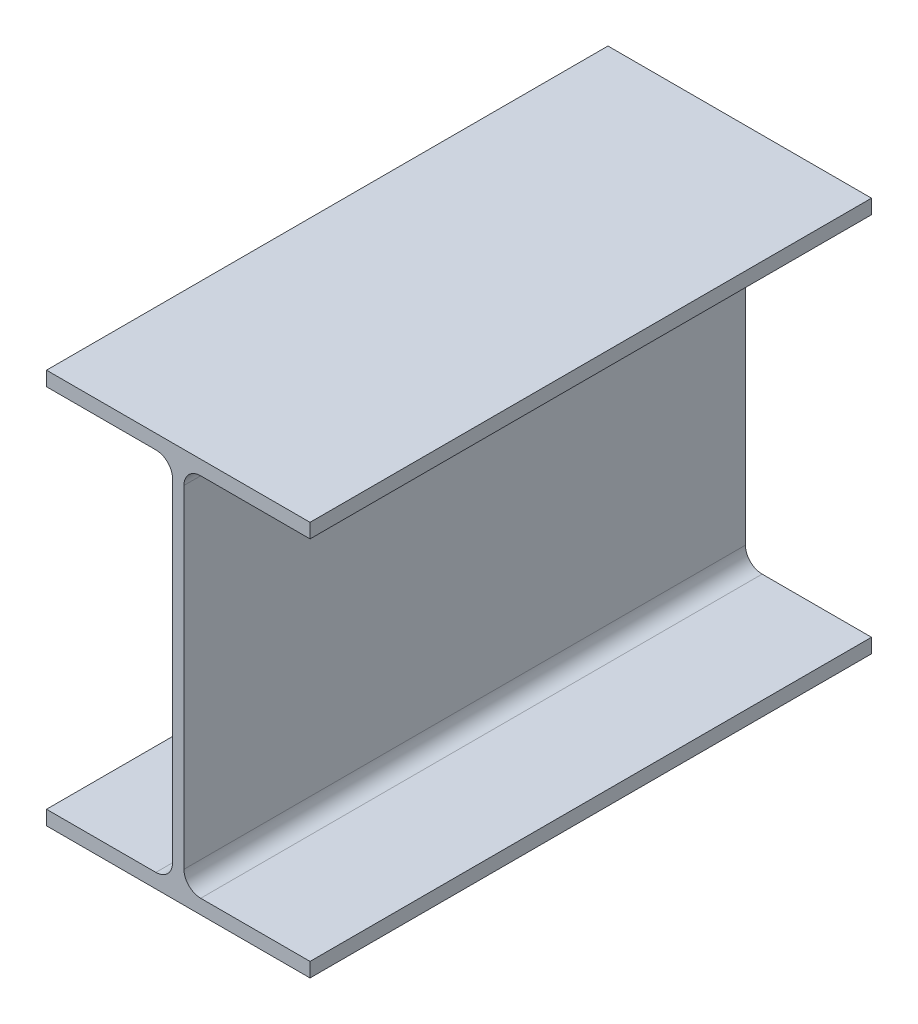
ISO-10303-21;
HEADER;
FILE_DESCRIPTION(('STEP AP214'),'2;1');
FILE_NAME('part.step','',(''),(''),'','','');
FILE_SCHEMA(('AUTOMOTIVE_DESIGN { 1 0 10303 214 1 1 1 1 }'));
ENDSEC;
DATA;
#1=APPLICATION_CONTEXT('core data for automotive mechanical design processes');
#2=APPLICATION_PROTOCOL_DEFINITION('international standard','automotive_design',2000,#1);
#3=PRODUCT_CONTEXT('',#1,'mechanical');
#4=PRODUCT('Part','Part','',(#3));
#5=PRODUCT_RELATED_PRODUCT_CATEGORY('part','',(#4));
#6=PRODUCT_DEFINITION_FORMATION('','',#4);
#7=PRODUCT_DEFINITION_CONTEXT('part definition',#1,'design');
#8=PRODUCT_DEFINITION('design','',#6,#7);
#9=PRODUCT_DEFINITION_SHAPE('','',#8);
#10=(LENGTH_UNIT() NAMED_UNIT(*) SI_UNIT(.MILLI.,.METRE.));
#11=(NAMED_UNIT(*) PLANE_ANGLE_UNIT() SI_UNIT($,.RADIAN.));
#12=(NAMED_UNIT(*) SI_UNIT($,.STERADIAN.) SOLID_ANGLE_UNIT());
#13=UNCERTAINTY_MEASURE_WITH_UNIT(LENGTH_MEASURE(1.E-05),#10,'distance_accuracy_value','');
#14=(GEOMETRIC_REPRESENTATION_CONTEXT(3) GLOBAL_UNCERTAINTY_ASSIGNED_CONTEXT((#13)) GLOBAL_UNIT_ASSIGNED_CONTEXT((#10,
#11,#12)) REPRESENTATION_CONTEXT('',''));
#15=CARTESIAN_POINT('',(0.,0.,0.));
#16=DIRECTION('',(0.,0.,1.));
#17=DIRECTION('',(1.,0.,0.));
#18=AXIS2_PLACEMENT_3D('',#15,#16,#17);
#19=CARTESIAN_POINT('',(50.0379999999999,-74.93,213.205063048));
#20=DIRECTION('',(0.,1.,0.));
#21=DIRECTION('',(0.,0.,1.));
#22=AXIS2_PLACEMENT_3D('',#19,#20,#21);
#23=PLANE('',#22);
#24=DIRECTION('',(1.,0.,0.));
#25=VECTOR('',#24,1.);
#26=CARTESIAN_POINT('',(50.0379999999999,-74.93,0.));
#27=LINE('',#26,#25);
#28=CARTESIAN_POINT('',(-50.0379999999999,-74.93,0.));
#29=VERTEX_POINT('',#28);
#30=CARTESIAN_POINT('',(50.0379999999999,-74.93,0.));
#31=VERTEX_POINT('',#30);
#32=EDGE_CURVE('E179',#29,#31,#27,.T.);
#33=ORIENTED_EDGE('',*,*,#32,.T.);
#34=DIRECTION('',(0.,0.,-1.));
#35=VECTOR('',#34,1.);
#36=CARTESIAN_POINT('',(50.0379999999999,-74.93,213.205063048));
#37=LINE('',#36,#35);
#38=CARTESIAN_POINT('',(50.0379999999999,-74.93,213.205063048));
#39=VERTEX_POINT('',#38);
#40=EDGE_CURVE('E11',#39,#31,#37,.T.);
#41=ORIENTED_EDGE('',*,*,#40,.F.);
#42=DIRECTION('',(1.,0.,0.));
#43=VECTOR('',#42,1.);
#44=CARTESIAN_POINT('',(50.0379999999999,-74.93,213.205063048));
#45=LINE('',#44,#43);
#46=CARTESIAN_POINT('',(-50.0379999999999,-74.93,213.205063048));
#47=VERTEX_POINT('',#46);
#48=EDGE_CURVE('E209',#47,#39,#45,.T.);
#49=ORIENTED_EDGE('',*,*,#48,.F.);
#50=DIRECTION('',(0.,0.,-1.));
#51=VECTOR('',#50,1.);
#52=CARTESIAN_POINT('',(-50.0379999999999,-74.93,213.205063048));
#53=LINE('',#52,#51);
#54=EDGE_CURVE('E175',#47,#29,#53,.T.);
#55=ORIENTED_EDGE('',*,*,#54,.T.);
#56=EDGE_LOOP('',(#33,#41,#49,#55));
#57=FACE_BOUND('',#56,.T.);
#58=ADVANCED_FACE('F35',(#57),#23,.F.);
#59=CARTESIAN_POINT('',(50.0379999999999,-69.469,213.205063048));
#60=DIRECTION('',(-1.,0.,0.));
#61=DIRECTION('',(0.,0.,1.));
#62=AXIS2_PLACEMENT_3D('',#59,#60,#61);
#63=PLANE('',#62);
#64=DIRECTION('',(0.,1.,0.));
#65=VECTOR('',#64,1.);
#66=CARTESIAN_POINT('',(50.0379999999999,-69.469,0.));
#67=LINE('',#66,#65);
#68=CARTESIAN_POINT('',(50.0379999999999,-69.469,0.));
#69=VERTEX_POINT('',#68);
#70=EDGE_CURVE('E182',#31,#69,#67,.T.);
#71=ORIENTED_EDGE('',*,*,#70,.T.);
#72=DIRECTION('',(0.,0.,-1.));
#73=VECTOR('',#72,1.);
#74=CARTESIAN_POINT('',(50.0379999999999,-69.469,213.205063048));
#75=LINE('',#74,#73);
#76=CARTESIAN_POINT('',(50.0379999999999,-69.469,213.205063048));
#77=VERTEX_POINT('',#76);
#78=EDGE_CURVE('E43',#77,#69,#75,.T.);
#79=ORIENTED_EDGE('',*,*,#78,.F.);
#80=DIRECTION('',(0.,1.,0.));
#81=VECTOR('',#80,1.);
#82=CARTESIAN_POINT('',(50.0379999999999,-69.469,213.205063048));
#83=LINE('',#82,#81);
#84=EDGE_CURVE('E118',#39,#77,#83,.T.);
#85=ORIENTED_EDGE('',*,*,#84,.F.);
#86=ORIENTED_EDGE('',*,*,#40,.T.);
#87=EDGE_LOOP('',(#71,#79,#85,#86));
#88=FACE_BOUND('',#87,.T.);
#89=ADVANCED_FACE('F307',(#88),#63,.F.);
#90=CARTESIAN_POINT('',(8.50900000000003,-69.469,213.205063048));
#91=DIRECTION('',(0.,-1.,0.));
#92=DIRECTION('',(1.,0.,0.));
#93=AXIS2_PLACEMENT_3D('',#90,#91,#92);
#94=PLANE('',#93);
#95=DIRECTION('',(-1.,0.,0.));
#96=VECTOR('',#95,1.);
#97=CARTESIAN_POINT('',(8.50900000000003,-69.469,0.));
#98=LINE('',#97,#96);
#99=CARTESIAN_POINT('',(8.50900000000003,-69.469,0.));
#100=VERTEX_POINT('',#99);
#101=EDGE_CURVE('E184',#69,#100,#98,.T.);
#102=ORIENTED_EDGE('',*,*,#101,.T.);
#103=DIRECTION('',(0.,0.,-1.));
#104=VECTOR('',#103,1.);
#105=CARTESIAN_POINT('',(8.50900000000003,-69.469,213.205063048));
#106=LINE('',#105,#104);
#107=CARTESIAN_POINT('',(8.50900000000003,-69.469,213.205063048));
#108=VERTEX_POINT('',#107);
#109=EDGE_CURVE('E240',#108,#100,#106,.T.);
#110=ORIENTED_EDGE('',*,*,#109,.F.);
#111=DIRECTION('',(-1.,0.,0.));
#112=VECTOR('',#111,1.);
#113=CARTESIAN_POINT('',(8.50900000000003,-69.469,213.205063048));
#114=LINE('',#113,#112);
#115=EDGE_CURVE('E248',#77,#108,#114,.T.);
#116=ORIENTED_EDGE('',*,*,#115,.F.);
#117=ORIENTED_EDGE('',*,*,#78,.T.);
#118=EDGE_LOOP('',(#102,#110,#116,#117));
#119=FACE_BOUND('',#118,.T.);
#120=ADVANCED_FACE('F246',(#119),#94,.F.);
#121=CARTESIAN_POINT('',(8.50900000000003,-63.119,213.205063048));
#122=DIRECTION('',(0.,0.,-1.));
#123=DIRECTION('',(-1.,0.,0.));
#124=AXIS2_PLACEMENT_3D('',#121,#122,#123);
#125=CYLINDRICAL_SURFACE('',#124,6.34999999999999);
#126=CARTESIAN_POINT('',(8.50900000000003,-63.119,0.));
#127=DIRECTION('',(0.,0.,-1.));
#128=DIRECTION('',(1.,0.,0.));
#129=AXIS2_PLACEMENT_3D('',#126,#127,#128);
#130=CIRCLE('',#129,6.34999999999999);
#131=CARTESIAN_POINT('',(2.15900000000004,-63.119,0.));
#132=VERTEX_POINT('',#131);
#133=EDGE_CURVE('E186',#100,#132,#130,.T.);
#134=ORIENTED_EDGE('',*,*,#133,.T.);
#135=DIRECTION('',(0.,0.,-1.));
#136=VECTOR('',#135,1.);
#137=CARTESIAN_POINT('',(2.15900000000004,-63.119,213.205063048));
#138=LINE('',#137,#136);
#139=CARTESIAN_POINT('',(2.15900000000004,-63.119,213.205063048));
#140=VERTEX_POINT('',#139);
#141=EDGE_CURVE('E237',#140,#132,#138,.T.);
#142=ORIENTED_EDGE('',*,*,#141,.F.);
#143=CARTESIAN_POINT('',(8.50900000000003,-63.119,213.205063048));
#144=DIRECTION('',(0.,0.,-1.));
#145=DIRECTION('',(1.,0.,0.));
#146=AXIS2_PLACEMENT_3D('',#143,#144,#145);
#147=CIRCLE('',#146,6.34999999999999);
#148=EDGE_CURVE('E266',#108,#140,#147,.T.);
#149=ORIENTED_EDGE('',*,*,#148,.F.);
#150=ORIENTED_EDGE('',*,*,#109,.T.);
#151=EDGE_LOOP('',(#134,#142,#149,#150));
#152=FACE_BOUND('',#151,.T.);
#153=ADVANCED_FACE('F257',(#152),#125,.F.);
#154=CARTESIAN_POINT('',(2.15900000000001,63.119,213.205063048));
#155=DIRECTION('',(-1.,0.,0.));
#156=DIRECTION('',(0.,-1.,0.));
#157=AXIS2_PLACEMENT_3D('',#154,#155,#156);
#158=PLANE('',#157);
#159=DIRECTION('',(0.,1.,0.));
#160=VECTOR('',#159,1.);
#161=CARTESIAN_POINT('',(2.15900000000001,63.119,0.));
#162=LINE('',#161,#160);
#163=CARTESIAN_POINT('',(2.15900000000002,63.119,0.));
#164=VERTEX_POINT('',#163);
#165=EDGE_CURVE('E188',#132,#164,#162,.T.);
#166=ORIENTED_EDGE('',*,*,#165,.T.);
#167=DIRECTION('',(0.,0.,-1.));
#168=VECTOR('',#167,1.);
#169=CARTESIAN_POINT('',(2.15900000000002,63.119,213.205063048));
#170=LINE('',#169,#168);
#171=CARTESIAN_POINT('',(2.15900000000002,63.119,213.205063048));
#172=VERTEX_POINT('',#171);
#173=EDGE_CURVE('E234',#172,#164,#170,.T.);
#174=ORIENTED_EDGE('',*,*,#173,.F.);
#175=DIRECTION('',(0.,1.,0.));
#176=VECTOR('',#175,1.);
#177=CARTESIAN_POINT('',(2.15900000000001,63.119,213.205063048));
#178=LINE('',#177,#176);
#179=EDGE_CURVE('E263',#140,#172,#178,.T.);
#180=ORIENTED_EDGE('',*,*,#179,.F.);
#181=ORIENTED_EDGE('',*,*,#141,.T.);
#182=EDGE_LOOP('',(#166,#174,#180,#181));
#183=FACE_BOUND('',#182,.T.);
#184=ADVANCED_FACE('F261',(#183),#158,.F.);
#185=CARTESIAN_POINT('',(8.50900000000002,63.119,213.205063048));
#186=DIRECTION('',(0.,0.,-1.));
#187=DIRECTION('',(-1.,0.,0.));
#188=AXIS2_PLACEMENT_3D('',#185,#186,#187);
#189=CYLINDRICAL_SURFACE('',#188,6.35);
#190=CARTESIAN_POINT('',(8.50900000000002,63.119,0.));
#191=DIRECTION('',(0.,0.,-1.));
#192=DIRECTION('',(1.,0.,0.));
#193=AXIS2_PLACEMENT_3D('',#190,#191,#192);
#194=CIRCLE('',#193,6.35);
#195=CARTESIAN_POINT('',(8.50900000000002,69.469,0.));
#196=VERTEX_POINT('',#195);
#197=EDGE_CURVE('E190',#164,#196,#194,.T.);
#198=ORIENTED_EDGE('',*,*,#197,.T.);
#199=DIRECTION('',(0.,0.,-1.));
#200=VECTOR('',#199,1.);
#201=CARTESIAN_POINT('',(8.50900000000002,69.469,213.205063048));
#202=LINE('',#201,#200);
#203=CARTESIAN_POINT('',(8.50900000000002,69.469,213.205063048));
#204=VERTEX_POINT('',#203);
#205=EDGE_CURVE('E231',#204,#196,#202,.T.);
#206=ORIENTED_EDGE('',*,*,#205,.F.);
#207=CARTESIAN_POINT('',(8.50900000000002,63.119,213.205063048));
#208=DIRECTION('',(0.,0.,-1.));
#209=DIRECTION('',(1.,0.,0.));
#210=AXIS2_PLACEMENT_3D('',#207,#208,#209);
#211=CIRCLE('',#210,6.35);
#212=EDGE_CURVE('E265',#172,#204,#211,.T.);
#213=ORIENTED_EDGE('',*,*,#212,.F.);
#214=ORIENTED_EDGE('',*,*,#173,.T.);
#215=EDGE_LOOP('',(#198,#206,#213,#214));
#216=FACE_BOUND('',#215,.T.);
#217=ADVANCED_FACE('F320',(#216),#189,.F.);
#218=CARTESIAN_POINT('',(50.0379999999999,69.469,213.205063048));
#219=DIRECTION('',(0.,1.,0.));
#220=DIRECTION('',(0.,0.,1.));
#221=AXIS2_PLACEMENT_3D('',#218,#219,#220);
#222=PLANE('',#221);
#223=DIRECTION('',(1.,0.,0.));
#224=VECTOR('',#223,1.);
#225=CARTESIAN_POINT('',(50.0379999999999,69.469,0.));
#226=LINE('',#225,#224);
#227=CARTESIAN_POINT('',(50.0379999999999,69.469,0.));
#228=VERTEX_POINT('',#227);
#229=EDGE_CURVE('E192',#196,#228,#226,.T.);
#230=ORIENTED_EDGE('',*,*,#229,.T.);
#231=DIRECTION('',(0.,0.,-1.));
#232=VECTOR('',#231,1.);
#233=CARTESIAN_POINT('',(50.0379999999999,69.469,213.205063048));
#234=LINE('',#233,#232);
#235=CARTESIAN_POINT('',(50.0379999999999,69.469,213.205063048));
#236=VERTEX_POINT('',#235);
#237=EDGE_CURVE('E228',#236,#228,#234,.T.);
#238=ORIENTED_EDGE('',*,*,#237,.F.);
#239=DIRECTION('',(1.,0.,0.));
#240=VECTOR('',#239,1.);
#241=CARTESIAN_POINT('',(50.0379999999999,69.469,213.205063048));
#242=LINE('',#241,#240);
#243=EDGE_CURVE('E268',#204,#236,#242,.T.);
#244=ORIENTED_EDGE('',*,*,#243,.F.);
#245=ORIENTED_EDGE('',*,*,#205,.T.);
#246=EDGE_LOOP('',(#230,#238,#244,#245));
#247=FACE_BOUND('',#246,.T.);
#248=ADVANCED_FACE('F323',(#247),#222,.F.);
#249=CARTESIAN_POINT('',(50.0379999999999,74.93,213.205063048));
#250=DIRECTION('',(-1.,0.,0.));
#251=DIRECTION('',(0.,0.,1.));
#252=AXIS2_PLACEMENT_3D('',#249,#250,#251);
#253=PLANE('',#252);
#254=DIRECTION('',(0.,1.,0.));
#255=VECTOR('',#254,1.);
#256=CARTESIAN_POINT('',(50.0379999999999,74.93,0.));
#257=LINE('',#256,#255);
#258=CARTESIAN_POINT('',(50.0379999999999,74.93,0.));
#259=VERTEX_POINT('',#258);
#260=EDGE_CURVE('E194',#228,#259,#257,.T.);
#261=ORIENTED_EDGE('',*,*,#260,.T.);
#262=DIRECTION('',(0.,0.,-1.));
#263=VECTOR('',#262,1.);
#264=CARTESIAN_POINT('',(50.0379999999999,74.93,213.205063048));
#265=LINE('',#264,#263);
#266=CARTESIAN_POINT('',(50.0379999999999,74.93,213.205063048));
#267=VERTEX_POINT('',#266);
#268=EDGE_CURVE('E225',#267,#259,#265,.T.);
#269=ORIENTED_EDGE('',*,*,#268,.F.);
#270=DIRECTION('',(0.,1.,0.));
#271=VECTOR('',#270,1.);
#272=CARTESIAN_POINT('',(50.0379999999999,74.93,213.205063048));
#273=LINE('',#272,#271);
#274=EDGE_CURVE('E274',#236,#267,#273,.T.);
#275=ORIENTED_EDGE('',*,*,#274,.F.);
#276=ORIENTED_EDGE('',*,*,#237,.T.);
#277=EDGE_LOOP('',(#261,#269,#275,#276));
#278=FACE_BOUND('',#277,.T.);
#279=ADVANCED_FACE('F327',(#278),#253,.F.);
#280=CARTESIAN_POINT('',(-50.038,74.93,213.205063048));
#281=DIRECTION('',(0.,-1.,0.));
#282=DIRECTION('',(0.,0.,-1.));
#283=AXIS2_PLACEMENT_3D('',#280,#281,#282);
#284=PLANE('',#283);
#285=DIRECTION('',(-1.,0.,0.));
#286=VECTOR('',#285,1.);
#287=CARTESIAN_POINT('',(-50.038,74.93,0.));
#288=LINE('',#287,#286);
#289=CARTESIAN_POINT('',(-50.038,74.93,0.));
#290=VERTEX_POINT('',#289);
#291=EDGE_CURVE('E196',#259,#290,#288,.T.);
#292=ORIENTED_EDGE('',*,*,#291,.T.);
#293=DIRECTION('',(0.,0.,-1.));
#294=VECTOR('',#293,1.);
#295=CARTESIAN_POINT('',(-50.038,74.93,213.205063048));
#296=LINE('',#295,#294);
#297=CARTESIAN_POINT('',(-50.038,74.93,213.205063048));
#298=VERTEX_POINT('',#297);
#299=EDGE_CURVE('E222',#298,#290,#296,.T.);
#300=ORIENTED_EDGE('',*,*,#299,.F.);
#301=DIRECTION('',(-1.,0.,0.));
#302=VECTOR('',#301,1.);
#303=CARTESIAN_POINT('',(-50.038,74.93,213.205063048));
#304=LINE('',#303,#302);
#305=EDGE_CURVE('E276',#267,#298,#304,.T.);
#306=ORIENTED_EDGE('',*,*,#305,.F.);
#307=ORIENTED_EDGE('',*,*,#268,.T.);
#308=EDGE_LOOP('',(#292,#300,#306,#307));
#309=FACE_BOUND('',#308,.T.);
#310=ADVANCED_FACE('F331',(#309),#284,.F.);
#311=CARTESIAN_POINT('',(-50.038,69.469,213.205063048));
#312=DIRECTION('',(1.,0.,0.));
#313=DIRECTION('',(0.,0.,-1.));
#314=AXIS2_PLACEMENT_3D('',#311,#312,#313);
#315=PLANE('',#314);
#316=DIRECTION('',(0.,-1.,0.));
#317=VECTOR('',#316,1.);
#318=CARTESIAN_POINT('',(-50.038,69.469,0.));
#319=LINE('',#318,#317);
#320=CARTESIAN_POINT('',(-50.038,69.469,0.));
#321=VERTEX_POINT('',#320);
#322=EDGE_CURVE('E198',#290,#321,#319,.T.);
#323=ORIENTED_EDGE('',*,*,#322,.T.);
#324=DIRECTION('',(0.,0.,-1.));
#325=VECTOR('',#324,1.);
#326=CARTESIAN_POINT('',(-50.038,69.469,213.205063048));
#327=LINE('',#326,#325);
#328=CARTESIAN_POINT('',(-50.038,69.469,213.205063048));
#329=VERTEX_POINT('',#328);
#330=EDGE_CURVE('E219',#329,#321,#327,.T.);
#331=ORIENTED_EDGE('',*,*,#330,.F.);
#332=DIRECTION('',(0.,-1.,0.));
#333=VECTOR('',#332,1.);
#334=CARTESIAN_POINT('',(-50.038,69.469,213.205063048));
#335=LINE('',#334,#333);
#336=EDGE_CURVE('E278',#298,#329,#335,.T.);
#337=ORIENTED_EDGE('',*,*,#336,.F.);
#338=ORIENTED_EDGE('',*,*,#299,.T.);
#339=EDGE_LOOP('',(#323,#331,#337,#338));
#340=FACE_BOUND('',#339,.T.);
#341=ADVANCED_FACE('F335',(#340),#315,.F.);
#342=CARTESIAN_POINT('',(-8.50899999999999,69.469,213.205063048));
#343=DIRECTION('',(0.,1.,0.));
#344=DIRECTION('',(0.,0.,1.));
#345=AXIS2_PLACEMENT_3D('',#342,#343,#344);
#346=PLANE('',#345);
#347=DIRECTION('',(1.,0.,0.));
#348=VECTOR('',#347,1.);
#349=CARTESIAN_POINT('',(-8.50899999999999,69.469,0.));
#350=LINE('',#349,#348);
#351=CARTESIAN_POINT('',(-8.50899999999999,69.469,0.));
#352=VERTEX_POINT('',#351);
#353=EDGE_CURVE('E200',#321,#352,#350,.T.);
#354=ORIENTED_EDGE('',*,*,#353,.T.);
#355=DIRECTION('',(0.,0.,-1.));
#356=VECTOR('',#355,1.);
#357=CARTESIAN_POINT('',(-8.50899999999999,69.469,213.205063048));
#358=LINE('',#357,#356);
#359=CARTESIAN_POINT('',(-8.50899999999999,69.469,213.205063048));
#360=VERTEX_POINT('',#359);
#361=EDGE_CURVE('E216',#360,#352,#358,.T.);
#362=ORIENTED_EDGE('',*,*,#361,.F.);
#363=DIRECTION('',(1.,0.,0.));
#364=VECTOR('',#363,1.);
#365=CARTESIAN_POINT('',(-8.50899999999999,69.469,213.205063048));
#366=LINE('',#365,#364);
#367=EDGE_CURVE('E280',#329,#360,#366,.T.);
#368=ORIENTED_EDGE('',*,*,#367,.F.);
#369=ORIENTED_EDGE('',*,*,#330,.T.);
#370=EDGE_LOOP('',(#354,#362,#368,#369));
#371=FACE_BOUND('',#370,.T.);
#372=ADVANCED_FACE('F339',(#371),#346,.F.);
#373=CARTESIAN_POINT('',(-8.50899999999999,63.119,213.205063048));
#374=DIRECTION('',(0.,0.,-1.));
#375=DIRECTION('',(-1.,0.,0.));
#376=AXIS2_PLACEMENT_3D('',#373,#374,#375);
#377=CYLINDRICAL_SURFACE('',#376,6.35);
#378=CARTESIAN_POINT('',(-8.50899999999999,63.119,0.));
#379=DIRECTION('',(0.,0.,-1.));
#380=DIRECTION('',(1.,0.,0.));
#381=AXIS2_PLACEMENT_3D('',#378,#379,#380);
#382=CIRCLE('',#381,6.35);
#383=CARTESIAN_POINT('',(-2.159,63.119,0.));
#384=VERTEX_POINT('',#383);
#385=EDGE_CURVE('E202',#352,#384,#382,.T.);
#386=ORIENTED_EDGE('',*,*,#385,.T.);
#387=DIRECTION('',(0.,0.,-1.));
#388=VECTOR('',#387,1.);
#389=CARTESIAN_POINT('',(-2.159,63.119,213.205063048));
#390=LINE('',#389,#388);
#391=CARTESIAN_POINT('',(-2.159,63.119,213.205063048));
#392=VERTEX_POINT('',#391);
#393=EDGE_CURVE('E213',#392,#384,#390,.T.);
#394=ORIENTED_EDGE('',*,*,#393,.F.);
#395=CARTESIAN_POINT('',(-8.50899999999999,63.119,213.205063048));
#396=DIRECTION('',(0.,0.,-1.));
#397=DIRECTION('',(1.,0.,0.));
#398=AXIS2_PLACEMENT_3D('',#395,#396,#397);
#399=CIRCLE('',#398,6.35);
#400=EDGE_CURVE('E282',#360,#392,#399,.T.);
#401=ORIENTED_EDGE('',*,*,#400,.F.);
#402=ORIENTED_EDGE('',*,*,#361,.T.);
#403=EDGE_LOOP('',(#386,#394,#401,#402));
#404=FACE_BOUND('',#403,.T.);
#405=ADVANCED_FACE('F288',(#404),#377,.F.);
#406=CARTESIAN_POINT('',(-2.15899999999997,-63.119,213.205063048));
#407=DIRECTION('',(1.,0.,0.));
#408=DIRECTION('',(0.,1.,0.));
#409=AXIS2_PLACEMENT_3D('',#406,#407,#408);
#410=PLANE('',#409);
#411=DIRECTION('',(0.,-1.,0.));
#412=VECTOR('',#411,1.);
#413=CARTESIAN_POINT('',(-2.15899999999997,-63.119,0.));
#414=LINE('',#413,#412);
#415=CARTESIAN_POINT('',(-2.15899999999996,-63.119,0.));
#416=VERTEX_POINT('',#415);
#417=EDGE_CURVE('E204',#384,#416,#414,.T.);
#418=ORIENTED_EDGE('',*,*,#417,.T.);
#419=DIRECTION('',(0.,0.,-1.));
#420=VECTOR('',#419,1.);
#421=CARTESIAN_POINT('',(-2.15899999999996,-63.119,213.205063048));
#422=LINE('',#421,#420);
#423=CARTESIAN_POINT('',(-2.15899999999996,-63.119,213.205063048));
#424=VERTEX_POINT('',#423);
#425=EDGE_CURVE('E170',#424,#416,#422,.T.);
#426=ORIENTED_EDGE('',*,*,#425,.F.);
#427=DIRECTION('',(0.,-1.,0.));
#428=VECTOR('',#427,1.);
#429=CARTESIAN_POINT('',(-2.15899999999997,-63.119,213.205063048));
#430=LINE('',#429,#428);
#431=EDGE_CURVE('E161',#392,#424,#430,.T.);
#432=ORIENTED_EDGE('',*,*,#431,.F.);
#433=ORIENTED_EDGE('',*,*,#393,.T.);
#434=EDGE_LOOP('',(#418,#426,#432,#433));
#435=FACE_BOUND('',#434,.T.);
#436=ADVANCED_FACE('F292',(#435),#410,.F.);
#437=CARTESIAN_POINT('',(-8.50899999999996,-63.119,213.205063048));
#438=DIRECTION('',(0.,0.,-1.));
#439=DIRECTION('',(-1.,0.,0.));
#440=AXIS2_PLACEMENT_3D('',#437,#438,#439);
#441=CYLINDRICAL_SURFACE('',#440,6.35);
#442=CARTESIAN_POINT('',(-8.50899999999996,-63.119,0.));
#443=DIRECTION('',(0.,0.,-1.));
#444=DIRECTION('',(1.,0.,0.));
#445=AXIS2_PLACEMENT_3D('',#442,#443,#444);
#446=CIRCLE('',#445,6.35);
#447=CARTESIAN_POINT('',(-8.50899999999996,-69.469,0.));
#448=VERTEX_POINT('',#447);
#449=EDGE_CURVE('E169',#416,#448,#446,.T.);
#450=ORIENTED_EDGE('',*,*,#449,.T.);
#451=DIRECTION('',(0.,0.,-1.));
#452=VECTOR('',#451,1.);
#453=CARTESIAN_POINT('',(-8.50899999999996,-69.469,213.205063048));
#454=LINE('',#453,#452);
#455=CARTESIAN_POINT('',(-8.50899999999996,-69.469,213.205063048));
#456=VERTEX_POINT('',#455);
#457=EDGE_CURVE('E166',#456,#448,#454,.T.);
#458=ORIENTED_EDGE('',*,*,#457,.F.);
#459=CARTESIAN_POINT('',(-8.50899999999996,-63.119,213.205063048));
#460=DIRECTION('',(0.,0.,-1.));
#461=DIRECTION('',(1.,0.,0.));
#462=AXIS2_PLACEMENT_3D('',#459,#460,#461);
#463=CIRCLE('',#462,6.35);
#464=EDGE_CURVE('E155',#424,#456,#463,.T.);
#465=ORIENTED_EDGE('',*,*,#464,.F.);
#466=ORIENTED_EDGE('',*,*,#425,.T.);
#467=EDGE_LOOP('',(#450,#458,#465,#466));
#468=FACE_BOUND('',#467,.T.);
#469=ADVANCED_FACE('F167',(#468),#441,.F.);
#470=CARTESIAN_POINT('',(-50.0379999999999,-69.469,213.205063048));
#471=DIRECTION('',(0.,-1.,0.));
#472=DIRECTION('',(0.,0.,-1.));
#473=AXIS2_PLACEMENT_3D('',#470,#471,#472);
#474=PLANE('',#473);
#475=DIRECTION('',(-1.,0.,0.));
#476=VECTOR('',#475,1.);
#477=CARTESIAN_POINT('',(-50.0379999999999,-69.469,0.));
#478=LINE('',#477,#476);
#479=CARTESIAN_POINT('',(-50.0379999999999,-69.469,0.));
#480=VERTEX_POINT('',#479);
#481=EDGE_CURVE('E104',#448,#480,#478,.T.);
#482=ORIENTED_EDGE('',*,*,#481,.T.);
#483=DIRECTION('',(0.,0.,-1.));
#484=VECTOR('',#483,1.);
#485=CARTESIAN_POINT('',(-50.0379999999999,-69.469,213.205063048));
#486=LINE('',#485,#484);
#487=CARTESIAN_POINT('',(-50.0379999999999,-69.469,213.205063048));
#488=VERTEX_POINT('',#487);
#489=EDGE_CURVE('E171',#488,#480,#486,.T.);
#490=ORIENTED_EDGE('',*,*,#489,.F.);
#491=DIRECTION('',(-1.,0.,0.));
#492=VECTOR('',#491,1.);
#493=CARTESIAN_POINT('',(-50.0379999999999,-69.469,213.205063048));
#494=LINE('',#493,#492);
#495=EDGE_CURVE('E159',#456,#488,#494,.T.);
#496=ORIENTED_EDGE('',*,*,#495,.F.);
#497=ORIENTED_EDGE('',*,*,#457,.T.);
#498=EDGE_LOOP('',(#482,#490,#496,#497));
#499=FACE_BOUND('',#498,.T.);
#500=ADVANCED_FACE('F173',(#499),#474,.F.);
#501=CARTESIAN_POINT('',(-50.0379999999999,-74.93,213.205063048));
#502=DIRECTION('',(1.,0.,0.));
#503=DIRECTION('',(0.,0.,-1.));
#504=AXIS2_PLACEMENT_3D('',#501,#502,#503);
#505=PLANE('',#504);
#506=DIRECTION('',(0.,-1.,0.));
#507=VECTOR('',#506,1.);
#508=CARTESIAN_POINT('',(-50.0379999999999,-74.93,0.));
#509=LINE('',#508,#507);
#510=EDGE_CURVE('E110',#480,#29,#509,.T.);
#511=ORIENTED_EDGE('',*,*,#510,.T.);
#512=ORIENTED_EDGE('',*,*,#54,.F.);
#513=DIRECTION('',(0.,-1.,0.));
#514=VECTOR('',#513,1.);
#515=CARTESIAN_POINT('',(-50.0379999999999,-74.93,213.205063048));
#516=LINE('',#515,#514);
#517=EDGE_CURVE('E51',#488,#47,#516,.T.);
#518=ORIENTED_EDGE('',*,*,#517,.F.);
#519=ORIENTED_EDGE('',*,*,#489,.T.);
#520=EDGE_LOOP('',(#511,#512,#518,#519));
#521=FACE_BOUND('',#520,.T.);
#522=ADVANCED_FACE('F296',(#521),#505,.F.);
#523=CARTESIAN_POINT('',(-8.50899999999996,-63.119,213.205063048));
#524=DIRECTION('',(0.,0.,1.));
#525=DIRECTION('',(1.,0.,0.));
#526=AXIS2_PLACEMENT_3D('',#523,#524,#525);
#527=PLANE('',#526);
#528=ORIENTED_EDGE('',*,*,#48,.T.);
#529=ORIENTED_EDGE('',*,*,#84,.T.);
#530=ORIENTED_EDGE('',*,*,#115,.T.);
#531=ORIENTED_EDGE('',*,*,#148,.T.);
#532=ORIENTED_EDGE('',*,*,#179,.T.);
#533=ORIENTED_EDGE('',*,*,#212,.T.);
#534=ORIENTED_EDGE('',*,*,#243,.T.);
#535=ORIENTED_EDGE('',*,*,#274,.T.);
#536=ORIENTED_EDGE('',*,*,#305,.T.);
#537=ORIENTED_EDGE('',*,*,#336,.T.);
#538=ORIENTED_EDGE('',*,*,#367,.T.);
#539=ORIENTED_EDGE('',*,*,#400,.T.);
#540=ORIENTED_EDGE('',*,*,#431,.T.);
#541=ORIENTED_EDGE('',*,*,#464,.T.);
#542=ORIENTED_EDGE('',*,*,#495,.T.);
#543=ORIENTED_EDGE('',*,*,#517,.T.);
#544=EDGE_LOOP('',(#528,#529,#530,#531,#532,#533,#534,#535,#536,#537,#538,#539,#540,#541,#542,#543));
#545=FACE_BOUND('',#544,.T.);
#546=ADVANCED_FACE('F157',(#545),#527,.T.);
#547=CARTESIAN_POINT('',(-8.50899999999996,-63.119,0.));
#548=DIRECTION('',(0.,0.,1.));
#549=DIRECTION('',(1.,0.,0.));
#550=AXIS2_PLACEMENT_3D('',#547,#548,#549);
#551=PLANE('',#550);
#552=ORIENTED_EDGE('',*,*,#32,.F.);
#553=ORIENTED_EDGE('',*,*,#510,.F.);
#554=ORIENTED_EDGE('',*,*,#481,.F.);
#555=ORIENTED_EDGE('',*,*,#449,.F.);
#556=ORIENTED_EDGE('',*,*,#417,.F.);
#557=ORIENTED_EDGE('',*,*,#385,.F.);
#558=ORIENTED_EDGE('',*,*,#353,.F.);
#559=ORIENTED_EDGE('',*,*,#322,.F.);
#560=ORIENTED_EDGE('',*,*,#291,.F.);
#561=ORIENTED_EDGE('',*,*,#260,.F.);
#562=ORIENTED_EDGE('',*,*,#229,.F.);
#563=ORIENTED_EDGE('',*,*,#197,.F.);
#564=ORIENTED_EDGE('',*,*,#165,.F.);
#565=ORIENTED_EDGE('',*,*,#133,.F.);
#566=ORIENTED_EDGE('',*,*,#101,.F.);
#567=ORIENTED_EDGE('',*,*,#70,.F.);
#568=EDGE_LOOP('',(#552,#553,#554,#555,#556,#557,#558,#559,#560,#561,#562,#563,#564,#565,#566,#567));
#569=FACE_BOUND('',#568,.T.);
#570=ADVANCED_FACE('F252',(#569),#551,.F.);
#571=CLOSED_SHELL('',(#58,#89,#120,#153,#184,#217,#248,#279,#310,#341,#372,#405,#436,#469,#500,
#522,#546,#570));
#572=MANIFOLD_SOLID_BREP('B2',#571);
#573=ADVANCED_BREP_SHAPE_REPRESENTATION('',(#18,#572),#14);
#574=SHAPE_DEFINITION_REPRESENTATION(#9,#573);
ENDSEC;
END-ISO-10303-21;
